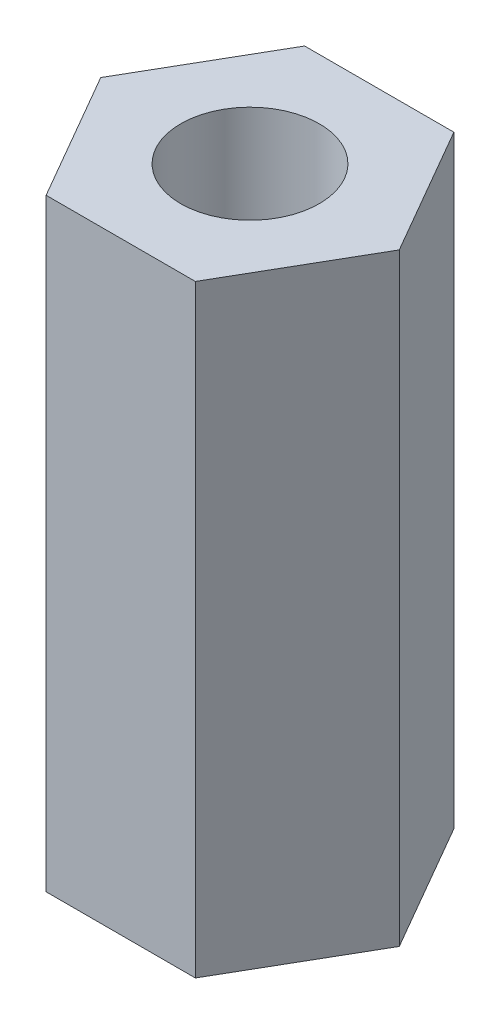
from build123d import *

# Parameters (mm, degrees)
BOSS_EXTRUDE1_DEPTH     = 11.1125
F_1_4_20_TAPPED_HOLE1_D = 5.1054


with BuildPart() as part:
    # Sketch1 → Boss-Extrude1 (new, symmetric)
    with BuildSketch(Plane(origin=(0, 0, 0), x_dir=(1, 0, 0), z_dir=(0, 1, 0))):
        Polygon((-5.499261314, 0), (-2.749630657, 4.7625), (2.749630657, 4.7625), (5.499261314, 0), (2.749630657, -4.7625), (-2.749630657, -4.7625), align=None)
    extrude(amount=BOSS_EXTRUDE1_DEPTH, both=True)

    # 1_4-20 Tapped Hole1 (through all)
    with Locations(Plane(origin=(0, 11.1125, 0), x_dir=(-1, 0, 0), z_dir=(0, 1, 0))):
        with Locations((0, 0)):
            Hole(F_1_4_20_TAPPED_HOLE1_D / 2)


solid = part.part
